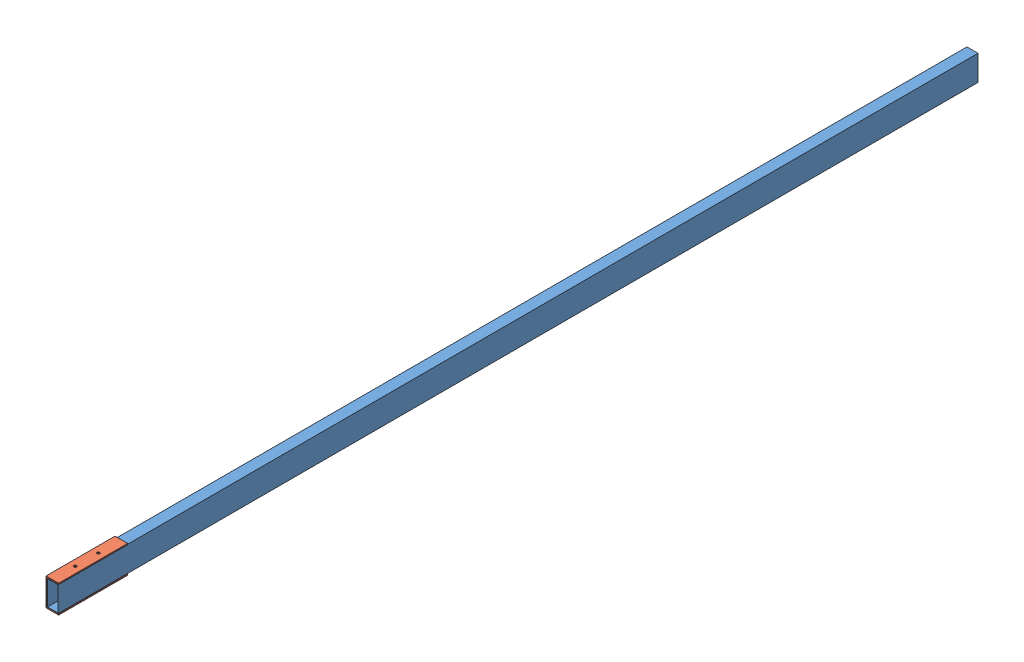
SolidWorks assembly BARRIER ARM.SLDASM, configuration Default (file format 11000). Lengths in mm.
Overall size (55 120 4000).
2 component instances, 2 part files, 2 mates.
Components (placement in the parent):
- arm-1: arm.SLDPRT [Default] at (1646.4761 2170.9878 932.6284) size (48 110 4000)
- rotating support base-1: rotating support base.SLDPRT [Default] at (1682.1446 2163.1657 4632.6284) size (55 120 300)
Mates (geometry in assembly coordinates):
- Coincident1: coincident: plane of arm-1 through (1622.4761 2225.9878 4932.6284) normal (0 1 0); plane of rotating support base-1 through (1672.4761 2225.9878 4932.6284) normal (0 -1 0)
- Concentric1: concentric: cylinder of arm-1 through (1644.9761 2225.9878 4832.6284) axis (0 1 0) radius 2.5; cylinder of rotating support base-1 through (1644.9761 2230.9878 4832.6284) axis (0 1 0) radius 2.75
